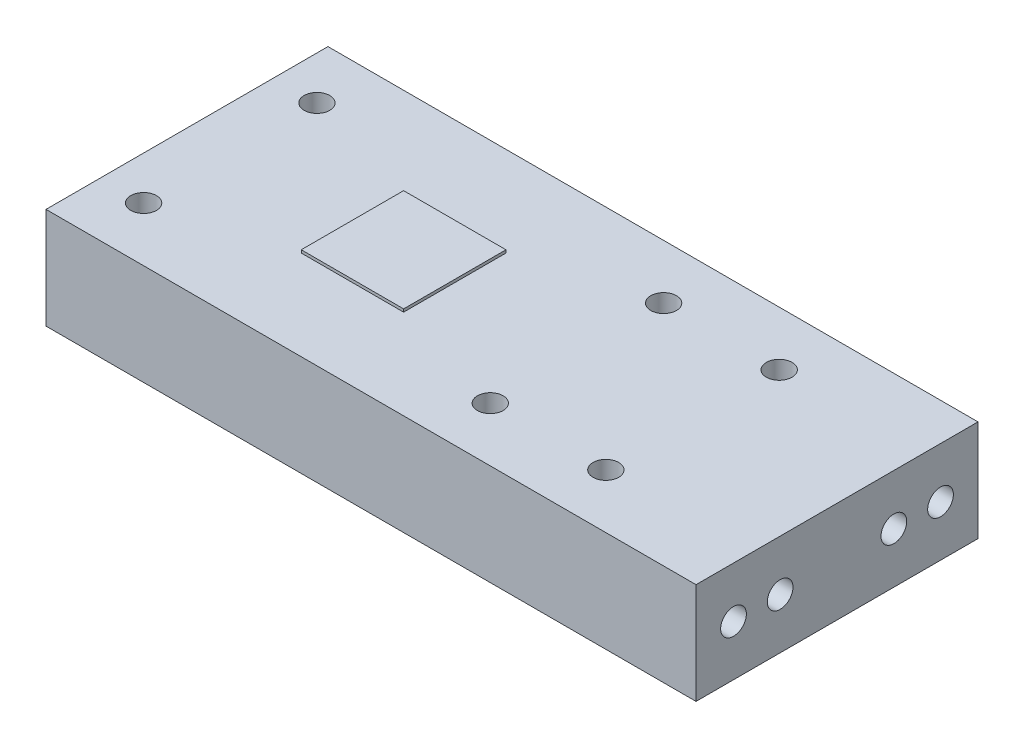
ISO-10303-21;
HEADER;
FILE_DESCRIPTION(('STEP AP214'),'2;1');
FILE_NAME('part.step','',(''),(''),'','','');
FILE_SCHEMA(('AUTOMOTIVE_DESIGN { 1 0 10303 214 1 1 1 1 }'));
ENDSEC;
DATA;
#1=APPLICATION_CONTEXT('core data for automotive mechanical design processes');
#2=APPLICATION_PROTOCOL_DEFINITION('international standard','automotive_design',2000,#1);
#3=PRODUCT_CONTEXT('',#1,'mechanical');
#4=PRODUCT('Part','Part','',(#3));
#5=PRODUCT_RELATED_PRODUCT_CATEGORY('part','',(#4));
#6=PRODUCT_DEFINITION_FORMATION('','',#4);
#7=PRODUCT_DEFINITION_CONTEXT('part definition',#1,'design');
#8=PRODUCT_DEFINITION('design','',#6,#7);
#9=PRODUCT_DEFINITION_SHAPE('','',#8);
#10=(LENGTH_UNIT() NAMED_UNIT(*) SI_UNIT(.MILLI.,.METRE.));
#11=(NAMED_UNIT(*) PLANE_ANGLE_UNIT() SI_UNIT($,.RADIAN.));
#12=(NAMED_UNIT(*) SI_UNIT($,.STERADIAN.) SOLID_ANGLE_UNIT());
#13=UNCERTAINTY_MEASURE_WITH_UNIT(LENGTH_MEASURE(1.E-05),#10,'distance_accuracy_value','');
#14=(GEOMETRIC_REPRESENTATION_CONTEXT(3) GLOBAL_UNCERTAINTY_ASSIGNED_CONTEXT((#13)) GLOBAL_UNIT_ASSIGNED_CONTEXT((#10,
#11,#12)) REPRESENTATION_CONTEXT('',''));
#15=CARTESIAN_POINT('',(0.,0.,0.));
#16=DIRECTION('',(0.,0.,1.));
#17=DIRECTION('',(1.,0.,0.));
#18=AXIS2_PLACEMENT_3D('',#15,#16,#17);
#19=CARTESIAN_POINT('',(57.15,8.89000000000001,24.7904));
#20=DIRECTION('',(0.,-1.,0.));
#21=DIRECTION('',(1.,0.,0.));
#22=AXIS2_PLACEMENT_3D('',#19,#20,#21);
#23=PLANE('',#22);
#24=CARTESIAN_POINT('',(44.4462,8.89000000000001,20.0152));
#25=DIRECTION('',(0.,1.,0.));
#26=DIRECTION('',(0.,0.,1.));
#27=AXIS2_PLACEMENT_3D('',#24,#25,#26);
#28=CIRCLE('',#27,1.13029999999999);
#29=CARTESIAN_POINT('',(44.4462,8.89000000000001,21.1455));
#30=VERTEX_POINT('',#29);
#31=EDGE_CURVE('E146',#30,#30,#28,.T.);
#32=ORIENTED_EDGE('',*,*,#31,.F.);
#33=EDGE_LOOP('',(#32));
#34=FACE_BOUND('',#33,.T.);
#35=CARTESIAN_POINT('',(44.4462,8.89000000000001,4.7752));
#36=DIRECTION('',(0.,1.,0.));
#37=DIRECTION('',(0.,0.,1.));
#38=AXIS2_PLACEMENT_3D('',#35,#36,#37);
#39=CIRCLE('',#38,1.13029999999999);
#40=CARTESIAN_POINT('',(44.4462,8.89000000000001,5.90549999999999));
#41=VERTEX_POINT('',#40);
#42=EDGE_CURVE('E152',#41,#41,#39,.T.);
#43=ORIENTED_EDGE('',*,*,#42,.F.);
#44=EDGE_LOOP('',(#43));
#45=FACE_BOUND('',#44,.T.);
#46=CARTESIAN_POINT('',(3.8062,8.89,4.7752));
#47=DIRECTION('',(0.,1.,0.));
#48=DIRECTION('',(0.,0.,1.));
#49=AXIS2_PLACEMENT_3D('',#46,#47,#48);
#50=CIRCLE('',#49,1.13029999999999);
#51=CARTESIAN_POINT('',(3.8062,8.89,5.90549999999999));
#52=VERTEX_POINT('',#51);
#53=EDGE_CURVE('E158',#52,#52,#50,.T.);
#54=ORIENTED_EDGE('',*,*,#53,.F.);
#55=EDGE_LOOP('',(#54));
#56=FACE_BOUND('',#55,.T.);
#57=CARTESIAN_POINT('',(34.2862,8.89,4.7752));
#58=DIRECTION('',(0.,1.,0.));
#59=DIRECTION('',(0.,0.,1.));
#60=AXIS2_PLACEMENT_3D('',#57,#58,#59);
#61=CIRCLE('',#60,1.13029999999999);
#62=CARTESIAN_POINT('',(34.2862,8.89,5.90549999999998));
#63=VERTEX_POINT('',#62);
#64=EDGE_CURVE('E164',#63,#63,#61,.T.);
#65=ORIENTED_EDGE('',*,*,#64,.F.);
#66=EDGE_LOOP('',(#65));
#67=FACE_BOUND('',#66,.T.);
#68=CARTESIAN_POINT('',(34.2862,8.89,20.0152));
#69=DIRECTION('',(0.,1.,0.));
#70=DIRECTION('',(0.,0.,1.));
#71=AXIS2_PLACEMENT_3D('',#68,#69,#70);
#72=CIRCLE('',#71,1.13029999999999);
#73=CARTESIAN_POINT('',(34.2862,8.89,21.1455));
#74=VERTEX_POINT('',#73);
#75=EDGE_CURVE('E170',#74,#74,#72,.T.);
#76=ORIENTED_EDGE('',*,*,#75,.F.);
#77=EDGE_LOOP('',(#76));
#78=FACE_BOUND('',#77,.T.);
#79=CARTESIAN_POINT('',(3.8062,8.89,20.0152));
#80=DIRECTION('',(0.,1.,0.));
#81=DIRECTION('',(0.,0.,1.));
#82=AXIS2_PLACEMENT_3D('',#79,#80,#81);
#83=CIRCLE('',#82,1.13029999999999);
#84=CARTESIAN_POINT('',(3.8062,8.89,21.1455));
#85=VERTEX_POINT('',#84);
#86=EDGE_CURVE('E176',#85,#85,#83,.T.);
#87=ORIENTED_EDGE('',*,*,#86,.F.);
#88=EDGE_LOOP('',(#87));
#89=FACE_BOUND('',#88,.T.);
#90=DIRECTION('',(-1.,0.,0.));
#91=VECTOR('',#90,1.);
#92=CARTESIAN_POINT('',(57.15,8.89000000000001,0.));
#93=LINE('',#92,#91);
#94=CARTESIAN_POINT('',(57.15,8.89000000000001,0.));
#95=VERTEX_POINT('',#94);
#96=CARTESIAN_POINT('',(0.,8.89,0.));
#97=VERTEX_POINT('',#96);
#98=EDGE_CURVE('E221',#95,#97,#93,.T.);
#99=ORIENTED_EDGE('',*,*,#98,.T.);
#100=DIRECTION('',(0.,0.,-1.));
#101=VECTOR('',#100,1.);
#102=CARTESIAN_POINT('',(0.,8.89,24.7904));
#103=LINE('',#102,#101);
#104=CARTESIAN_POINT('',(0.,8.89,24.7904));
#105=VERTEX_POINT('',#104);
#106=EDGE_CURVE('E227',#105,#97,#103,.T.);
#107=ORIENTED_EDGE('',*,*,#106,.F.);
#108=DIRECTION('',(-1.,0.,0.));
#109=VECTOR('',#108,1.);
#110=CARTESIAN_POINT('',(57.15,8.89000000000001,24.7904));
#111=LINE('',#110,#109);
#112=CARTESIAN_POINT('',(57.15,8.89000000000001,24.7904));
#113=VERTEX_POINT('',#112);
#114=EDGE_CURVE('E225',#113,#105,#111,.T.);
#115=ORIENTED_EDGE('',*,*,#114,.F.);
#116=DIRECTION('',(0.,0.,-1.));
#117=VECTOR('',#116,1.);
#118=CARTESIAN_POINT('',(57.15,8.89000000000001,24.7904));
#119=LINE('',#118,#117);
#120=EDGE_CURVE('E237',#113,#95,#119,.T.);
#121=ORIENTED_EDGE('',*,*,#120,.T.);
#122=EDGE_LOOP('',(#99,#107,#115,#121));
#123=FACE_BOUND('',#122,.T.);
#124=DIRECTION('',(-1.,0.,0.));
#125=VECTOR('',#124,1.);
#126=CARTESIAN_POINT('',(14.5462,8.89,7.8952));
#127=LINE('',#126,#125);
#128=CARTESIAN_POINT('',(23.5462,8.89,7.8952));
#129=VERTEX_POINT('',#128);
#130=CARTESIAN_POINT('',(14.5462,8.89,7.8952));
#131=VERTEX_POINT('',#130);
#132=EDGE_CURVE('E188',#129,#131,#127,.T.);
#133=ORIENTED_EDGE('',*,*,#132,.F.);
#134=DIRECTION('',(0.,0.,-1.));
#135=VECTOR('',#134,1.);
#136=CARTESIAN_POINT('',(23.5462,8.89,16.8952));
#137=LINE('',#136,#135);
#138=CARTESIAN_POINT('',(23.5462,8.89,16.8952));
#139=VERTEX_POINT('',#138);
#140=EDGE_CURVE('E193',#139,#129,#137,.T.);
#141=ORIENTED_EDGE('',*,*,#140,.F.);
#142=DIRECTION('',(1.,0.,0.));
#143=VECTOR('',#142,1.);
#144=CARTESIAN_POINT('',(14.5462,8.89,16.8952));
#145=LINE('',#144,#143);
#146=CARTESIAN_POINT('',(14.5462,8.89,16.8952));
#147=VERTEX_POINT('',#146);
#148=EDGE_CURVE('E57',#147,#139,#145,.T.);
#149=ORIENTED_EDGE('',*,*,#148,.F.);
#150=DIRECTION('',(0.,0.,1.));
#151=VECTOR('',#150,1.);
#152=CARTESIAN_POINT('',(14.5462,8.89,16.8952));
#153=LINE('',#152,#151);
#154=EDGE_CURVE('E52',#131,#147,#153,.T.);
#155=ORIENTED_EDGE('',*,*,#154,.F.);
#156=EDGE_LOOP('',(#133,#141,#149,#155));
#157=FACE_BOUND('',#156,.T.);
#158=ADVANCED_FACE('F37',(#34,#45,#56,#67,#78,#89,#123,#157),#23,.F.);
#159=CARTESIAN_POINT('',(0.,8.89,24.7904));
#160=DIRECTION('',(1.,0.,0.));
#161=DIRECTION('',(0.,1.,0.));
#162=AXIS2_PLACEMENT_3D('',#159,#160,#161);
#163=PLANE('',#162);
#164=CARTESIAN_POINT('',(0.,4.445,12.3952));
#165=DIRECTION('',(-1.,0.,0.));
#166=DIRECTION('',(0.,0.,1.));
#167=AXIS2_PLACEMENT_3D('',#164,#165,#166);
#168=CIRCLE('',#167,1.1303);
#169=CARTESIAN_POINT('',(0.,4.445,13.5255));
#170=VERTEX_POINT('',#169);
#171=EDGE_CURVE('E182',#170,#170,#168,.T.);
#172=ORIENTED_EDGE('',*,*,#171,.F.);
#173=EDGE_LOOP('',(#172));
#174=FACE_BOUND('',#173,.T.);
#175=DIRECTION('',(0.,-1.,0.));
#176=VECTOR('',#175,1.);
#177=CARTESIAN_POINT('',(0.,8.89,0.));
#178=LINE('',#177,#176);
#179=CARTESIAN_POINT('',(0.,0.,0.));
#180=VERTEX_POINT('',#179);
#181=EDGE_CURVE('E216',#97,#180,#178,.T.);
#182=ORIENTED_EDGE('',*,*,#181,.T.);
#183=DIRECTION('',(0.,0.,-1.));
#184=VECTOR('',#183,1.);
#185=CARTESIAN_POINT('',(0.,0.,24.7904));
#186=LINE('',#185,#184);
#187=CARTESIAN_POINT('',(0.,0.,24.7904));
#188=VERTEX_POINT('',#187);
#189=EDGE_CURVE('E11',#188,#180,#186,.T.);
#190=ORIENTED_EDGE('',*,*,#189,.F.);
#191=DIRECTION('',(0.,-1.,0.));
#192=VECTOR('',#191,1.);
#193=CARTESIAN_POINT('',(0.,8.89,24.7904));
#194=LINE('',#193,#192);
#195=EDGE_CURVE('E217',#105,#188,#194,.T.);
#196=ORIENTED_EDGE('',*,*,#195,.F.);
#197=ORIENTED_EDGE('',*,*,#106,.T.);
#198=EDGE_LOOP('',(#182,#190,#196,#197));
#199=FACE_BOUND('',#198,.T.);
#200=ADVANCED_FACE('F39',(#174,#199),#163,.F.);
#201=CARTESIAN_POINT('',(0.,0.,24.7904));
#202=DIRECTION('',(0.,1.,0.));
#203=DIRECTION('',(0.,0.,1.));
#204=AXIS2_PLACEMENT_3D('',#201,#202,#203);
#205=PLANE('',#204);
#206=CARTESIAN_POINT('',(44.4462,0.,20.0152));
#207=DIRECTION('',(0.,1.,0.));
#208=DIRECTION('',(0.,0.,1.));
#209=AXIS2_PLACEMENT_3D('',#206,#207,#208);
#210=CIRCLE('',#209,1.1303);
#211=CARTESIAN_POINT('',(44.4462,0.,21.1455));
#212=VERTEX_POINT('',#211);
#213=EDGE_CURVE('E149',#212,#212,#210,.T.);
#214=ORIENTED_EDGE('',*,*,#213,.T.);
#215=EDGE_LOOP('',(#214));
#216=FACE_BOUND('',#215,.T.);
#217=CARTESIAN_POINT('',(44.4462,0.,4.7752));
#218=DIRECTION('',(0.,1.,0.));
#219=DIRECTION('',(0.,0.,1.));
#220=AXIS2_PLACEMENT_3D('',#217,#218,#219);
#221=CIRCLE('',#220,1.1303);
#222=CARTESIAN_POINT('',(44.4462,0.,5.9055));
#223=VERTEX_POINT('',#222);
#224=EDGE_CURVE('E155',#223,#223,#221,.T.);
#225=ORIENTED_EDGE('',*,*,#224,.T.);
#226=EDGE_LOOP('',(#225));
#227=FACE_BOUND('',#226,.T.);
#228=CARTESIAN_POINT('',(3.8062,0.,4.7752));
#229=DIRECTION('',(0.,1.,0.));
#230=DIRECTION('',(0.,0.,1.));
#231=AXIS2_PLACEMENT_3D('',#228,#229,#230);
#232=CIRCLE('',#231,1.1303);
#233=CARTESIAN_POINT('',(3.8062,0.,5.90549999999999));
#234=VERTEX_POINT('',#233);
#235=EDGE_CURVE('E161',#234,#234,#232,.T.);
#236=ORIENTED_EDGE('',*,*,#235,.T.);
#237=EDGE_LOOP('',(#236));
#238=FACE_BOUND('',#237,.T.);
#239=CARTESIAN_POINT('',(34.2862,0.,4.7752));
#240=DIRECTION('',(0.,1.,0.));
#241=DIRECTION('',(0.,0.,1.));
#242=AXIS2_PLACEMENT_3D('',#239,#240,#241);
#243=CIRCLE('',#242,1.1303);
#244=CARTESIAN_POINT('',(34.2862,0.,5.9055));
#245=VERTEX_POINT('',#244);
#246=EDGE_CURVE('E167',#245,#245,#243,.T.);
#247=ORIENTED_EDGE('',*,*,#246,.T.);
#248=EDGE_LOOP('',(#247));
#249=FACE_BOUND('',#248,.T.);
#250=CARTESIAN_POINT('',(34.2862,0.,20.0152));
#251=DIRECTION('',(0.,1.,0.));
#252=DIRECTION('',(0.,0.,1.));
#253=AXIS2_PLACEMENT_3D('',#250,#251,#252);
#254=CIRCLE('',#253,1.1303);
#255=CARTESIAN_POINT('',(34.2862,0.,21.1455));
#256=VERTEX_POINT('',#255);
#257=EDGE_CURVE('E173',#256,#256,#254,.T.);
#258=ORIENTED_EDGE('',*,*,#257,.T.);
#259=EDGE_LOOP('',(#258));
#260=FACE_BOUND('',#259,.T.);
#261=CARTESIAN_POINT('',(3.8062,0.,20.0152));
#262=DIRECTION('',(0.,1.,0.));
#263=DIRECTION('',(0.,0.,1.));
#264=AXIS2_PLACEMENT_3D('',#261,#262,#263);
#265=CIRCLE('',#264,1.1303);
#266=CARTESIAN_POINT('',(3.8062,0.,21.1455));
#267=VERTEX_POINT('',#266);
#268=EDGE_CURVE('E179',#267,#267,#265,.T.);
#269=ORIENTED_EDGE('',*,*,#268,.T.);
#270=EDGE_LOOP('',(#269));
#271=FACE_BOUND('',#270,.T.);
#272=DIRECTION('',(1.,0.,0.));
#273=VECTOR('',#272,1.);
#274=CARTESIAN_POINT('',(0.,0.,0.));
#275=LINE('',#274,#273);
#276=CARTESIAN_POINT('',(57.15,0.,0.));
#277=VERTEX_POINT('',#276);
#278=EDGE_CURVE('E230',#180,#277,#275,.T.);
#279=ORIENTED_EDGE('',*,*,#278,.T.);
#280=DIRECTION('',(0.,0.,-1.));
#281=VECTOR('',#280,1.);
#282=CARTESIAN_POINT('',(57.15,0.,24.7904));
#283=LINE('',#282,#281);
#284=CARTESIAN_POINT('',(57.15,0.,24.7904));
#285=VERTEX_POINT('',#284);
#286=EDGE_CURVE('E45',#285,#277,#283,.T.);
#287=ORIENTED_EDGE('',*,*,#286,.F.);
#288=DIRECTION('',(1.,0.,0.));
#289=VECTOR('',#288,1.);
#290=CARTESIAN_POINT('',(0.,0.,24.7904));
#291=LINE('',#290,#289);
#292=EDGE_CURVE('E220',#188,#285,#291,.T.);
#293=ORIENTED_EDGE('',*,*,#292,.F.);
#294=ORIENTED_EDGE('',*,*,#189,.T.);
#295=EDGE_LOOP('',(#279,#287,#293,#294));
#296=FACE_BOUND('',#295,.T.);
#297=ADVANCED_FACE('F259',(#216,#227,#238,#249,#260,#271,#296),#205,.F.);
#298=CARTESIAN_POINT('',(57.15,0.,24.7904));
#299=DIRECTION('',(-1.,0.,0.));
#300=DIRECTION('',(0.,0.,1.));
#301=AXIS2_PLACEMENT_3D('',#298,#299,#300);
#302=PLANE('',#301);
#303=CARTESIAN_POINT('',(57.15,4.445,17.3952));
#304=DIRECTION('',(1.,0.,0.));
#305=DIRECTION('',(0.,0.,-1.));
#306=AXIS2_PLACEMENT_3D('',#303,#304,#305);
#307=CIRCLE('',#306,1.13029999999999);
#308=CARTESIAN_POINT('',(57.15,4.445,16.2649));
#309=VERTEX_POINT('',#308);
#310=EDGE_CURVE('E124',#309,#309,#307,.T.);
#311=ORIENTED_EDGE('',*,*,#310,.F.);
#312=EDGE_LOOP('',(#311));
#313=FACE_BOUND('',#312,.T.);
#314=CARTESIAN_POINT('',(57.15,4.445,7.3952));
#315=DIRECTION('',(1.,0.,0.));
#316=DIRECTION('',(0.,0.,-1.));
#317=AXIS2_PLACEMENT_3D('',#314,#315,#316);
#318=CIRCLE('',#317,1.13029999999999);
#319=CARTESIAN_POINT('',(57.15,4.445,6.26490000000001));
#320=VERTEX_POINT('',#319);
#321=EDGE_CURVE('E123',#320,#320,#318,.T.);
#322=ORIENTED_EDGE('',*,*,#321,.F.);
#323=EDGE_LOOP('',(#322));
#324=FACE_BOUND('',#323,.T.);
#325=CARTESIAN_POINT('',(57.15,4.445,21.4952));
#326=DIRECTION('',(1.,0.,0.));
#327=DIRECTION('',(0.,0.,-1.));
#328=AXIS2_PLACEMENT_3D('',#325,#326,#327);
#329=CIRCLE('',#328,1.13029999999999);
#330=CARTESIAN_POINT('',(57.15,4.445,20.3649));
#331=VERTEX_POINT('',#330);
#332=EDGE_CURVE('E134',#331,#331,#329,.T.);
#333=ORIENTED_EDGE('',*,*,#332,.F.);
#334=EDGE_LOOP('',(#333));
#335=FACE_BOUND('',#334,.T.);
#336=CARTESIAN_POINT('',(57.15,4.445,3.2952));
#337=DIRECTION('',(1.,0.,0.));
#338=DIRECTION('',(0.,0.,-1.));
#339=AXIS2_PLACEMENT_3D('',#336,#337,#338);
#340=CIRCLE('',#339,1.13029999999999);
#341=CARTESIAN_POINT('',(57.15,4.445,2.16490000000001));
#342=VERTEX_POINT('',#341);
#343=EDGE_CURVE('E140',#342,#342,#340,.T.);
#344=ORIENTED_EDGE('',*,*,#343,.F.);
#345=EDGE_LOOP('',(#344));
#346=FACE_BOUND('',#345,.T.);
#347=DIRECTION('',(0.,1.,0.));
#348=VECTOR('',#347,1.);
#349=CARTESIAN_POINT('',(57.15,0.,0.));
#350=LINE('',#349,#348);
#351=EDGE_CURVE('E232',#277,#95,#350,.T.);
#352=ORIENTED_EDGE('',*,*,#351,.T.);
#353=ORIENTED_EDGE('',*,*,#120,.F.);
#354=DIRECTION('',(0.,1.,0.));
#355=VECTOR('',#354,1.);
#356=CARTESIAN_POINT('',(57.15,0.,24.7904));
#357=LINE('',#356,#355);
#358=EDGE_CURVE('E223',#285,#113,#357,.T.);
#359=ORIENTED_EDGE('',*,*,#358,.F.);
#360=ORIENTED_EDGE('',*,*,#286,.T.);
#361=EDGE_LOOP('',(#352,#353,#359,#360));
#362=FACE_BOUND('',#361,.T.);
#363=ADVANCED_FACE('F244',(#313,#324,#335,#346,#362),#302,.F.);
#364=CARTESIAN_POINT('',(0.,0.,24.7904));
#365=DIRECTION('',(0.,0.,1.));
#366=DIRECTION('',(1.,0.,0.));
#367=AXIS2_PLACEMENT_3D('',#364,#365,#366);
#368=PLANE('',#367);
#369=ORIENTED_EDGE('',*,*,#195,.T.);
#370=ORIENTED_EDGE('',*,*,#292,.T.);
#371=ORIENTED_EDGE('',*,*,#358,.T.);
#372=ORIENTED_EDGE('',*,*,#114,.T.);
#373=EDGE_LOOP('',(#369,#370,#371,#372));
#374=FACE_BOUND('',#373,.T.);
#375=ADVANCED_FACE('F258',(#374),#368,.T.);
#376=CARTESIAN_POINT('',(0.,0.,0.));
#377=DIRECTION('',(0.,0.,1.));
#378=DIRECTION('',(1.,0.,0.));
#379=AXIS2_PLACEMENT_3D('',#376,#377,#378);
#380=PLANE('',#379);
#381=ORIENTED_EDGE('',*,*,#181,.F.);
#382=ORIENTED_EDGE('',*,*,#98,.F.);
#383=ORIENTED_EDGE('',*,*,#351,.F.);
#384=ORIENTED_EDGE('',*,*,#278,.F.);
#385=EDGE_LOOP('',(#381,#382,#383,#384));
#386=FACE_BOUND('',#385,.T.);
#387=ADVANCED_FACE('F250',(#386),#380,.F.);
#388=CARTESIAN_POINT('',(14.5462,9.14,7.8952));
#389=DIRECTION('',(0.,0.,1.));
#390=DIRECTION('',(1.,0.,0.));
#391=AXIS2_PLACEMENT_3D('',#388,#389,#390);
#392=PLANE('',#391);
#393=ORIENTED_EDGE('',*,*,#132,.T.);
#394=DIRECTION('',(0.,-1.,0.));
#395=VECTOR('',#394,1.);
#396=CARTESIAN_POINT('',(14.5462,9.14,7.8952));
#397=LINE('',#396,#395);
#398=CARTESIAN_POINT('',(14.5462,9.14,7.8952));
#399=VERTEX_POINT('',#398);
#400=EDGE_CURVE('E214',#399,#131,#397,.T.);
#401=ORIENTED_EDGE('',*,*,#400,.F.);
#402=DIRECTION('',(-1.,0.,0.));
#403=VECTOR('',#402,1.);
#404=CARTESIAN_POINT('',(14.5462,9.14,7.8952));
#405=LINE('',#404,#403);
#406=CARTESIAN_POINT('',(23.5462,9.14,7.8952));
#407=VERTEX_POINT('',#406);
#408=EDGE_CURVE('E189',#407,#399,#405,.T.);
#409=ORIENTED_EDGE('',*,*,#408,.F.);
#410=DIRECTION('',(0.,-1.,0.));
#411=VECTOR('',#410,1.);
#412=CARTESIAN_POINT('',(23.5462,9.14,7.8952));
#413=LINE('',#412,#411);
#414=EDGE_CURVE('E199',#407,#129,#413,.T.);
#415=ORIENTED_EDGE('',*,*,#414,.T.);
#416=EDGE_LOOP('',(#393,#401,#409,#415));
#417=FACE_BOUND('',#416,.T.);
#418=ADVANCED_FACE('F280',(#417),#392,.F.);
#419=CARTESIAN_POINT('',(14.5462,9.14,16.8952));
#420=DIRECTION('',(1.,0.,0.));
#421=DIRECTION('',(0.,1.,0.));
#422=AXIS2_PLACEMENT_3D('',#419,#420,#421);
#423=PLANE('',#422);
#424=ORIENTED_EDGE('',*,*,#154,.T.);
#425=DIRECTION('',(0.,-1.,0.));
#426=VECTOR('',#425,1.);
#427=CARTESIAN_POINT('',(14.5462,9.14,16.8952));
#428=LINE('',#427,#426);
#429=CARTESIAN_POINT('',(14.5462,9.14,16.8952));
#430=VERTEX_POINT('',#429);
#431=EDGE_CURVE('E211',#430,#147,#428,.T.);
#432=ORIENTED_EDGE('',*,*,#431,.F.);
#433=DIRECTION('',(0.,0.,1.));
#434=VECTOR('',#433,1.);
#435=CARTESIAN_POINT('',(14.5462,9.14,16.8952));
#436=LINE('',#435,#434);
#437=EDGE_CURVE('E192',#399,#430,#436,.T.);
#438=ORIENTED_EDGE('',*,*,#437,.F.);
#439=ORIENTED_EDGE('',*,*,#400,.T.);
#440=EDGE_LOOP('',(#424,#432,#438,#439));
#441=FACE_BOUND('',#440,.T.);
#442=ADVANCED_FACE('F285',(#441),#423,.F.);
#443=CARTESIAN_POINT('',(14.5462,9.14,16.8952));
#444=DIRECTION('',(0.,0.,-1.));
#445=DIRECTION('',(-1.,0.,0.));
#446=AXIS2_PLACEMENT_3D('',#443,#444,#445);
#447=PLANE('',#446);
#448=ORIENTED_EDGE('',*,*,#148,.T.);
#449=DIRECTION('',(0.,-1.,0.));
#450=VECTOR('',#449,1.);
#451=CARTESIAN_POINT('',(23.5462,9.14,16.8952));
#452=LINE('',#451,#450);
#453=CARTESIAN_POINT('',(23.5462,9.14,16.8952));
#454=VERTEX_POINT('',#453);
#455=EDGE_CURVE('E208',#454,#139,#452,.T.);
#456=ORIENTED_EDGE('',*,*,#455,.F.);
#457=DIRECTION('',(1.,0.,0.));
#458=VECTOR('',#457,1.);
#459=CARTESIAN_POINT('',(14.5462,9.14,16.8952));
#460=LINE('',#459,#458);
#461=EDGE_CURVE('E195',#430,#454,#460,.T.);
#462=ORIENTED_EDGE('',*,*,#461,.F.);
#463=ORIENTED_EDGE('',*,*,#431,.T.);
#464=EDGE_LOOP('',(#448,#456,#462,#463));
#465=FACE_BOUND('',#464,.T.);
#466=ADVANCED_FACE('F289',(#465),#447,.F.);
#467=CARTESIAN_POINT('',(23.5462,9.14,16.8952));
#468=DIRECTION('',(-1.,0.,0.));
#469=DIRECTION('',(0.,-1.,0.));
#470=AXIS2_PLACEMENT_3D('',#467,#468,#469);
#471=PLANE('',#470);
#472=ORIENTED_EDGE('',*,*,#140,.T.);
#473=ORIENTED_EDGE('',*,*,#414,.F.);
#474=DIRECTION('',(0.,0.,-1.));
#475=VECTOR('',#474,1.);
#476=CARTESIAN_POINT('',(23.5462,9.14,16.8952));
#477=LINE('',#476,#475);
#478=EDGE_CURVE('E197',#454,#407,#477,.T.);
#479=ORIENTED_EDGE('',*,*,#478,.F.);
#480=ORIENTED_EDGE('',*,*,#455,.T.);
#481=EDGE_LOOP('',(#472,#473,#479,#480));
#482=FACE_BOUND('',#481,.T.);
#483=ADVANCED_FACE('F293',(#482),#471,.F.);
#484=CARTESIAN_POINT('',(0.,9.14,0.));
#485=DIRECTION('',(0.,1.,0.));
#486=DIRECTION('',(0.,0.,1.));
#487=AXIS2_PLACEMENT_3D('',#484,#485,#486);
#488=PLANE('',#487);
#489=ORIENTED_EDGE('',*,*,#408,.T.);
#490=ORIENTED_EDGE('',*,*,#437,.T.);
#491=ORIENTED_EDGE('',*,*,#461,.T.);
#492=ORIENTED_EDGE('',*,*,#478,.T.);
#493=EDGE_LOOP('',(#489,#490,#491,#492));
#494=FACE_BOUND('',#493,.T.);
#495=ADVANCED_FACE('F297',(#494),#488,.T.);
#496=CARTESIAN_POINT('',(7.62,4.445,12.3952));
#497=DIRECTION('',(-1.,0.,0.));
#498=DIRECTION('',(0.,0.,1.));
#499=AXIS2_PLACEMENT_3D('',#496,#497,#498);
#500=CONICAL_SURFACE('',#499,1.1303,1.02974425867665);
#501=CARTESIAN_POINT('',(8.29915275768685,4.445,12.3952));
#502=VERTEX_POINT('',#501);
#503=VERTEX_LOOP('',#502);
#504=FACE_BOUND('',#503,.T.);
#505=CARTESIAN_POINT('',(7.62,4.445,12.3952));
#506=DIRECTION('',(-1.,0.,0.));
#507=DIRECTION('',(0.,0.,1.));
#508=AXIS2_PLACEMENT_3D('',#505,#506,#507);
#509=CIRCLE('',#508,1.1303);
#510=CARTESIAN_POINT('',(7.62,4.445,13.5255));
#511=VERTEX_POINT('',#510);
#512=EDGE_CURVE('E185',#511,#511,#509,.T.);
#513=ORIENTED_EDGE('',*,*,#512,.T.);
#514=EDGE_LOOP('',(#513));
#515=FACE_BOUND('',#514,.T.);
#516=ADVANCED_FACE('F301',(#504,#515),#500,.F.);
#517=CARTESIAN_POINT('',(0.,4.445,12.3952));
#518=DIRECTION('',(-1.,0.,0.));
#519=DIRECTION('',(0.,0.,1.));
#520=AXIS2_PLACEMENT_3D('',#517,#518,#519);
#521=CYLINDRICAL_SURFACE('',#520,1.1303);
#522=ORIENTED_EDGE('',*,*,#512,.F.);
#523=EDGE_LOOP('',(#522));
#524=FACE_BOUND('',#523,.T.);
#525=ORIENTED_EDGE('',*,*,#171,.T.);
#526=EDGE_LOOP('',(#525));
#527=FACE_BOUND('',#526,.T.);
#528=ADVANCED_FACE('F305',(#524,#527),#521,.F.);
#529=CARTESIAN_POINT('',(3.8062,8.89,20.0152));
#530=DIRECTION('',(0.,1.,0.));
#531=DIRECTION('',(0.,0.,1.));
#532=AXIS2_PLACEMENT_3D('',#529,#530,#531);
#533=CYLINDRICAL_SURFACE('',#532,1.13029999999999);
#534=ORIENTED_EDGE('',*,*,#268,.F.);
#535=EDGE_LOOP('',(#534));
#536=FACE_BOUND('',#535,.T.);
#537=ORIENTED_EDGE('',*,*,#86,.T.);
#538=EDGE_LOOP('',(#537));
#539=FACE_BOUND('',#538,.T.);
#540=ADVANCED_FACE('F309',(#536,#539),#533,.F.);
#541=CARTESIAN_POINT('',(34.2862,8.89,20.0152));
#542=DIRECTION('',(0.,1.,0.));
#543=DIRECTION('',(0.,0.,1.));
#544=AXIS2_PLACEMENT_3D('',#541,#542,#543);
#545=CYLINDRICAL_SURFACE('',#544,1.13029999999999);
#546=ORIENTED_EDGE('',*,*,#257,.F.);
#547=EDGE_LOOP('',(#546));
#548=FACE_BOUND('',#547,.T.);
#549=ORIENTED_EDGE('',*,*,#75,.T.);
#550=EDGE_LOOP('',(#549));
#551=FACE_BOUND('',#550,.T.);
#552=ADVANCED_FACE('F313',(#548,#551),#545,.F.);
#553=CARTESIAN_POINT('',(34.2862,8.89,4.7752));
#554=DIRECTION('',(0.,1.,0.));
#555=DIRECTION('',(0.,0.,1.));
#556=AXIS2_PLACEMENT_3D('',#553,#554,#555);
#557=CYLINDRICAL_SURFACE('',#556,1.13029999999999);
#558=ORIENTED_EDGE('',*,*,#246,.F.);
#559=EDGE_LOOP('',(#558));
#560=FACE_BOUND('',#559,.T.);
#561=ORIENTED_EDGE('',*,*,#64,.T.);
#562=EDGE_LOOP('',(#561));
#563=FACE_BOUND('',#562,.T.);
#564=ADVANCED_FACE('F317',(#560,#563),#557,.F.);
#565=CARTESIAN_POINT('',(3.8062,8.89,4.7752));
#566=DIRECTION('',(0.,1.,0.));
#567=DIRECTION('',(0.,0.,1.));
#568=AXIS2_PLACEMENT_3D('',#565,#566,#567);
#569=CYLINDRICAL_SURFACE('',#568,1.13029999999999);
#570=ORIENTED_EDGE('',*,*,#235,.F.);
#571=EDGE_LOOP('',(#570));
#572=FACE_BOUND('',#571,.T.);
#573=ORIENTED_EDGE('',*,*,#53,.T.);
#574=EDGE_LOOP('',(#573));
#575=FACE_BOUND('',#574,.T.);
#576=ADVANCED_FACE('F321',(#572,#575),#569,.F.);
#577=CARTESIAN_POINT('',(44.4462,8.89,4.7752));
#578=DIRECTION('',(0.,1.,0.));
#579=DIRECTION('',(0.,0.,1.));
#580=AXIS2_PLACEMENT_3D('',#577,#578,#579);
#581=CYLINDRICAL_SURFACE('',#580,1.13029999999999);
#582=ORIENTED_EDGE('',*,*,#224,.F.);
#583=EDGE_LOOP('',(#582));
#584=FACE_BOUND('',#583,.T.);
#585=ORIENTED_EDGE('',*,*,#42,.T.);
#586=EDGE_LOOP('',(#585));
#587=FACE_BOUND('',#586,.T.);
#588=ADVANCED_FACE('F325',(#584,#587),#581,.F.);
#589=CARTESIAN_POINT('',(44.4462,8.89,20.0152));
#590=DIRECTION('',(0.,1.,0.));
#591=DIRECTION('',(0.,0.,1.));
#592=AXIS2_PLACEMENT_3D('',#589,#590,#591);
#593=CYLINDRICAL_SURFACE('',#592,1.13029999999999);
#594=ORIENTED_EDGE('',*,*,#213,.F.);
#595=EDGE_LOOP('',(#594));
#596=FACE_BOUND('',#595,.T.);
#597=ORIENTED_EDGE('',*,*,#31,.T.);
#598=EDGE_LOOP('',(#597));
#599=FACE_BOUND('',#598,.T.);
#600=ADVANCED_FACE('F329',(#596,#599),#593,.F.);
#601=CARTESIAN_POINT('',(49.53,4.445,3.2952));
#602=DIRECTION('',(1.,0.,0.));
#603=DIRECTION('',(0.,0.,-1.));
#604=AXIS2_PLACEMENT_3D('',#601,#602,#603);
#605=CONICAL_SURFACE('',#604,1.13029999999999,1.02974425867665);
#606=CARTESIAN_POINT('',(48.8508472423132,4.445,3.2952));
#607=VERTEX_POINT('',#606);
#608=VERTEX_LOOP('',#607);
#609=FACE_BOUND('',#608,.T.);
#610=CARTESIAN_POINT('',(49.53,4.445,3.2952));
#611=DIRECTION('',(1.,0.,0.));
#612=DIRECTION('',(0.,0.,-1.));
#613=AXIS2_PLACEMENT_3D('',#610,#611,#612);
#614=CIRCLE('',#613,1.13029999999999);
#615=CARTESIAN_POINT('',(49.53,4.445,2.16490000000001));
#616=VERTEX_POINT('',#615);
#617=EDGE_CURVE('E143',#616,#616,#614,.T.);
#618=ORIENTED_EDGE('',*,*,#617,.T.);
#619=EDGE_LOOP('',(#618));
#620=FACE_BOUND('',#619,.T.);
#621=ADVANCED_FACE('F333',(#609,#620),#605,.F.);
#622=CARTESIAN_POINT('',(57.15,4.445,3.2952));
#623=DIRECTION('',(1.,0.,0.));
#624=DIRECTION('',(0.,0.,-1.));
#625=AXIS2_PLACEMENT_3D('',#622,#623,#624);
#626=CYLINDRICAL_SURFACE('',#625,1.13029999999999);
#627=ORIENTED_EDGE('',*,*,#617,.F.);
#628=EDGE_LOOP('',(#627));
#629=FACE_BOUND('',#628,.T.);
#630=ORIENTED_EDGE('',*,*,#343,.T.);
#631=EDGE_LOOP('',(#630));
#632=FACE_BOUND('',#631,.T.);
#633=ADVANCED_FACE('F337',(#629,#632),#626,.F.);
#634=CARTESIAN_POINT('',(49.53,4.445,21.4952));
#635=DIRECTION('',(1.,0.,0.));
#636=DIRECTION('',(0.,0.,-1.));
#637=AXIS2_PLACEMENT_3D('',#634,#635,#636);
#638=CONICAL_SURFACE('',#637,1.13029999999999,1.02974425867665);
#639=CARTESIAN_POINT('',(48.8508472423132,4.445,21.4952));
#640=VERTEX_POINT('',#639);
#641=VERTEX_LOOP('',#640);
#642=FACE_BOUND('',#641,.T.);
#643=CARTESIAN_POINT('',(49.53,4.445,21.4952));
#644=DIRECTION('',(1.,0.,0.));
#645=DIRECTION('',(0.,0.,-1.));
#646=AXIS2_PLACEMENT_3D('',#643,#644,#645);
#647=CIRCLE('',#646,1.13029999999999);
#648=CARTESIAN_POINT('',(49.53,4.445,20.3649));
#649=VERTEX_POINT('',#648);
#650=EDGE_CURVE('E137',#649,#649,#647,.T.);
#651=ORIENTED_EDGE('',*,*,#650,.T.);
#652=EDGE_LOOP('',(#651));
#653=FACE_BOUND('',#652,.T.);
#654=ADVANCED_FACE('F341',(#642,#653),#638,.F.);
#655=CARTESIAN_POINT('',(57.15,4.445,21.4952));
#656=DIRECTION('',(1.,0.,0.));
#657=DIRECTION('',(0.,0.,-1.));
#658=AXIS2_PLACEMENT_3D('',#655,#656,#657);
#659=CYLINDRICAL_SURFACE('',#658,1.13029999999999);
#660=ORIENTED_EDGE('',*,*,#650,.F.);
#661=EDGE_LOOP('',(#660));
#662=FACE_BOUND('',#661,.T.);
#663=ORIENTED_EDGE('',*,*,#332,.T.);
#664=EDGE_LOOP('',(#663));
#665=FACE_BOUND('',#664,.T.);
#666=ADVANCED_FACE('F345',(#662,#665),#659,.F.);
#667=CARTESIAN_POINT('',(49.53,4.445,7.3952));
#668=DIRECTION('',(1.,0.,0.));
#669=DIRECTION('',(0.,0.,-1.));
#670=AXIS2_PLACEMENT_3D('',#667,#668,#669);
#671=CONICAL_SURFACE('',#670,1.13029999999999,1.02974425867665);
#672=CARTESIAN_POINT('',(48.8508472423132,4.445,7.3952));
#673=VERTEX_POINT('',#672);
#674=VERTEX_LOOP('',#673);
#675=FACE_BOUND('',#674,.T.);
#676=CARTESIAN_POINT('',(49.53,4.445,7.3952));
#677=DIRECTION('',(1.,0.,0.));
#678=DIRECTION('',(0.,0.,-1.));
#679=AXIS2_PLACEMENT_3D('',#676,#677,#678);
#680=CIRCLE('',#679,1.13029999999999);
#681=CARTESIAN_POINT('',(49.53,4.445,6.26490000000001));
#682=VERTEX_POINT('',#681);
#683=EDGE_CURVE('E127',#682,#682,#680,.T.);
#684=ORIENTED_EDGE('',*,*,#683,.T.);
#685=EDGE_LOOP('',(#684));
#686=FACE_BOUND('',#685,.T.);
#687=ADVANCED_FACE('F349',(#675,#686),#671,.F.);
#688=CARTESIAN_POINT('',(57.15,4.445,7.3952));
#689=DIRECTION('',(1.,0.,0.));
#690=DIRECTION('',(0.,0.,-1.));
#691=AXIS2_PLACEMENT_3D('',#688,#689,#690);
#692=CYLINDRICAL_SURFACE('',#691,1.13029999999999);
#693=ORIENTED_EDGE('',*,*,#683,.F.);
#694=EDGE_LOOP('',(#693));
#695=FACE_BOUND('',#694,.T.);
#696=ORIENTED_EDGE('',*,*,#321,.T.);
#697=EDGE_LOOP('',(#696));
#698=FACE_BOUND('',#697,.T.);
#699=ADVANCED_FACE('F117',(#695,#698),#692,.F.);
#700=CARTESIAN_POINT('',(49.53,4.445,17.3952));
#701=DIRECTION('',(1.,0.,0.));
#702=DIRECTION('',(0.,0.,-1.));
#703=AXIS2_PLACEMENT_3D('',#700,#701,#702);
#704=CONICAL_SURFACE('',#703,1.13029999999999,1.02974425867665);
#705=CARTESIAN_POINT('',(48.8508472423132,4.445,17.3952));
#706=VERTEX_POINT('',#705);
#707=VERTEX_LOOP('',#706);
#708=FACE_BOUND('',#707,.T.);
#709=CARTESIAN_POINT('',(49.53,4.445,17.3952));
#710=DIRECTION('',(1.,0.,0.));
#711=DIRECTION('',(0.,0.,-1.));
#712=AXIS2_PLACEMENT_3D('',#709,#710,#711);
#713=CIRCLE('',#712,1.13029999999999);
#714=CARTESIAN_POINT('',(49.53,4.445,16.2649));
#715=VERTEX_POINT('',#714);
#716=EDGE_CURVE('E121',#715,#715,#713,.T.);
#717=ORIENTED_EDGE('',*,*,#716,.T.);
#718=EDGE_LOOP('',(#717));
#719=FACE_BOUND('',#718,.T.);
#720=ADVANCED_FACE('F113',(#708,#719),#704,.F.);
#721=CARTESIAN_POINT('',(57.15,4.445,17.3952));
#722=DIRECTION('',(1.,0.,0.));
#723=DIRECTION('',(0.,0.,-1.));
#724=AXIS2_PLACEMENT_3D('',#721,#722,#723);
#725=CYLINDRICAL_SURFACE('',#724,1.13029999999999);
#726=ORIENTED_EDGE('',*,*,#716,.F.);
#727=EDGE_LOOP('',(#726));
#728=FACE_BOUND('',#727,.T.);
#729=ORIENTED_EDGE('',*,*,#310,.T.);
#730=EDGE_LOOP('',(#729));
#731=FACE_BOUND('',#730,.T.);
#732=ADVANCED_FACE('F116',(#728,#731),#725,.F.);
#733=CLOSED_SHELL('',(#158,#200,#297,#363,#375,#387,#418,#442,#466,#483,#495,#516,#528,#540,
#552,#564,#576,#588,#600,#621,#633,#654,#666,#687,#699,#720,#732));
#734=MANIFOLD_SOLID_BREP('B2',#733);
#735=ADVANCED_BREP_SHAPE_REPRESENTATION('',(#18,#734),#14);
#736=SHAPE_DEFINITION_REPRESENTATION(#9,#735);
ENDSEC;
END-ISO-10303-21;
